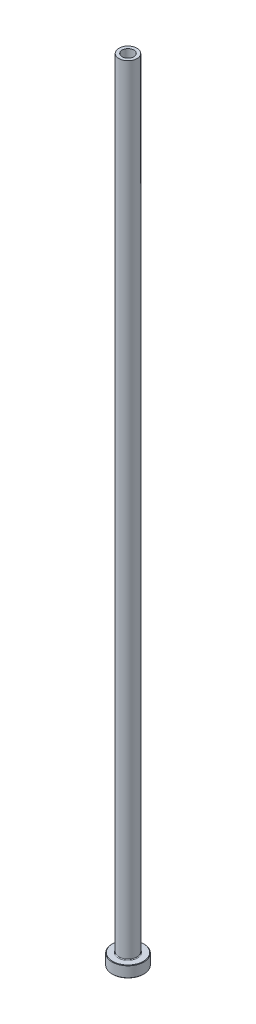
ISO-10303-21;
HEADER;
FILE_DESCRIPTION(('STEP AP214'),'2;1');
FILE_NAME('part.step','',(''),(''),'','','');
FILE_SCHEMA(('AUTOMOTIVE_DESIGN { 1 0 10303 214 1 1 1 1 }'));
ENDSEC;
DATA;
#1=APPLICATION_CONTEXT('core data for automotive mechanical design processes');
#2=APPLICATION_PROTOCOL_DEFINITION('international standard','automotive_design',2000,#1);
#3=PRODUCT_CONTEXT('',#1,'mechanical');
#4=PRODUCT('Part','Part','',(#3));
#5=PRODUCT_RELATED_PRODUCT_CATEGORY('part','',(#4));
#6=PRODUCT_DEFINITION_FORMATION('','',#4);
#7=PRODUCT_DEFINITION_CONTEXT('part definition',#1,'design');
#8=PRODUCT_DEFINITION('design','',#6,#7);
#9=PRODUCT_DEFINITION_SHAPE('','',#8);
#10=(LENGTH_UNIT() NAMED_UNIT(*) SI_UNIT(.MILLI.,.METRE.));
#11=(NAMED_UNIT(*) PLANE_ANGLE_UNIT() SI_UNIT($,.RADIAN.));
#12=(NAMED_UNIT(*) SI_UNIT($,.STERADIAN.) SOLID_ANGLE_UNIT());
#13=UNCERTAINTY_MEASURE_WITH_UNIT(LENGTH_MEASURE(1.E-05),#10,'distance_accuracy_value','');
#14=(GEOMETRIC_REPRESENTATION_CONTEXT(3) GLOBAL_UNCERTAINTY_ASSIGNED_CONTEXT((#13)) GLOBAL_UNIT_ASSIGNED_CONTEXT((#10,
#11,#12)) REPRESENTATION_CONTEXT('',''));
#15=CARTESIAN_POINT('',(0.,0.,0.));
#16=DIRECTION('',(0.,0.,1.));
#17=DIRECTION('',(1.,0.,0.));
#18=AXIS2_PLACEMENT_3D('',#15,#16,#17);
#19=CARTESIAN_POINT('',(0.,92.1876809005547,0.));
#20=DIRECTION('',(0.,1.,0.));
#21=DIRECTION('',(0.,0.,1.));
#22=AXIS2_PLACEMENT_3D('',#19,#20,#21);
#23=CYLINDRICAL_SURFACE('',#22,2.60000000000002);
#24=CARTESIAN_POINT('',(0.,350.,0.));
#25=DIRECTION('',(0.,1.,0.));
#26=DIRECTION('',(0.,0.,1.));
#27=AXIS2_PLACEMENT_3D('',#24,#25,#26);
#28=CIRCLE('',#27,2.60000000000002);
#29=CARTESIAN_POINT('',(0.,350.,2.60000000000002));
#30=VERTEX_POINT('',#29);
#31=EDGE_CURVE('E62',#30,#30,#28,.T.);
#32=ORIENTED_EDGE('',*,*,#31,.T.);
#33=EDGE_LOOP('',(#32));
#34=FACE_BOUND('',#33,.T.);
#35=CARTESIAN_POINT('',(0.,305.,0.));
#36=DIRECTION('',(0.,1.,0.));
#37=DIRECTION('',(0.,0.,1.));
#38=AXIS2_PLACEMENT_3D('',#35,#36,#37);
#39=CIRCLE('',#38,2.60000000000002);
#40=CARTESIAN_POINT('',(0.,305.,2.60000000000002));
#41=VERTEX_POINT('',#40);
#42=EDGE_CURVE('E71',#41,#41,#39,.T.);
#43=ORIENTED_EDGE('',*,*,#42,.F.);
#44=EDGE_LOOP('',(#43));
#45=FACE_BOUND('',#44,.T.);
#46=ADVANCED_FACE('F30',(#34,#45),#23,.F.);
#47=CARTESIAN_POINT('',(-2.60000000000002,350.,0.));
#48=DIRECTION('',(0.,1.,0.));
#49=DIRECTION('',(0.,0.,1.));
#50=AXIS2_PLACEMENT_3D('',#47,#48,#49);
#51=PLANE('',#50);
#52=CARTESIAN_POINT('',(0.,350.,0.));
#53=DIRECTION('',(0.,1.,0.));
#54=DIRECTION('',(0.,0.,1.));
#55=AXIS2_PLACEMENT_3D('',#52,#53,#54);
#56=CIRCLE('',#55,4.00000000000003);
#57=CARTESIAN_POINT('',(0.,350.,4.00000000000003));
#58=VERTEX_POINT('',#57);
#59=EDGE_CURVE('E65',#58,#58,#56,.T.);
#60=ORIENTED_EDGE('',*,*,#59,.T.);
#61=EDGE_LOOP('',(#60));
#62=FACE_BOUND('',#61,.T.);
#63=ORIENTED_EDGE('',*,*,#31,.F.);
#64=EDGE_LOOP('',(#63));
#65=FACE_BOUND('',#64,.T.);
#66=ADVANCED_FACE('F79',(#62,#65),#51,.T.);
#67=CARTESIAN_POINT('',(0.,92.1876809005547,0.));
#68=DIRECTION('',(0.,1.,0.));
#69=DIRECTION('',(0.,0.,1.));
#70=AXIS2_PLACEMENT_3D('',#67,#68,#69);
#71=CYLINDRICAL_SURFACE('',#70,4.00000000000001);
#72=CARTESIAN_POINT('',(0.,5.3,0.));
#73=DIRECTION('',(0.,1.,0.));
#74=DIRECTION('',(0.,0.,1.));
#75=AXIS2_PLACEMENT_3D('',#72,#73,#74);
#76=CIRCLE('',#75,4.00000000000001);
#77=CARTESIAN_POINT('',(0.,5.3,4.00000000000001));
#78=VERTEX_POINT('',#77);
#79=EDGE_CURVE('E59',#78,#78,#76,.T.);
#80=ORIENTED_EDGE('',*,*,#79,.T.);
#81=EDGE_LOOP('',(#80));
#82=FACE_BOUND('',#81,.T.);
#83=ORIENTED_EDGE('',*,*,#59,.F.);
#84=EDGE_LOOP('',(#83));
#85=FACE_BOUND('',#84,.T.);
#86=ADVANCED_FACE('F85',(#82,#85),#71,.T.);
#87=CARTESIAN_POINT('',(-3.99999999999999,5.,0.));
#88=DIRECTION('',(0.,1.,0.));
#89=DIRECTION('',(0.,0.,1.));
#90=AXIS2_PLACEMENT_3D('',#87,#88,#89);
#91=PLANE('',#90);
#92=CARTESIAN_POINT('',(0.,5.,0.));
#93=DIRECTION('',(0.,1.,0.));
#94=DIRECTION('',(0.,0.,1.));
#95=AXIS2_PLACEMENT_3D('',#92,#93,#94);
#96=CIRCLE('',#95,6.79999999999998);
#97=CARTESIAN_POINT('',(0.,5.,6.79999999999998));
#98=VERTEX_POINT('',#97);
#99=EDGE_CURVE('E53',#98,#98,#96,.T.);
#100=ORIENTED_EDGE('',*,*,#99,.T.);
#101=EDGE_LOOP('',(#100));
#102=FACE_BOUND('',#101,.T.);
#103=CARTESIAN_POINT('',(0.,5.,0.));
#104=DIRECTION('',(0.,1.,0.));
#105=DIRECTION('',(0.,0.,1.));
#106=AXIS2_PLACEMENT_3D('',#103,#104,#105);
#107=CIRCLE('',#106,4.30000000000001);
#108=CARTESIAN_POINT('',(0.,5.,4.30000000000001));
#109=VERTEX_POINT('',#108);
#110=EDGE_CURVE('E56',#109,#109,#107,.F.);
#111=ORIENTED_EDGE('',*,*,#110,.T.);
#112=EDGE_LOOP('',(#111));
#113=FACE_BOUND('',#112,.T.);
#114=ADVANCED_FACE('F111',(#102,#113),#91,.T.);
#115=CARTESIAN_POINT('',(0.,92.1876809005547,0.));
#116=DIRECTION('',(0.,1.,0.));
#117=DIRECTION('',(0.,0.,1.));
#118=AXIS2_PLACEMENT_3D('',#115,#116,#117);
#119=CYLINDRICAL_SURFACE('',#118,6.99999999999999);
#120=CARTESIAN_POINT('',(0.,4.8,0.));
#121=DIRECTION('',(0.,1.,0.));
#122=DIRECTION('',(0.,0.,1.));
#123=AXIS2_PLACEMENT_3D('',#120,#121,#122);
#124=CIRCLE('',#123,6.99999999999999);
#125=CARTESIAN_POINT('',(0.,4.8,6.99999999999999));
#126=VERTEX_POINT('',#125);
#127=EDGE_CURVE('E45',#126,#126,#124,.F.);
#128=ORIENTED_EDGE('',*,*,#127,.T.);
#129=EDGE_LOOP('',(#128));
#130=FACE_BOUND('',#129,.T.);
#131=CARTESIAN_POINT('',(0.,0.199999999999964,0.));
#132=DIRECTION('',(0.,-1.,0.));
#133=DIRECTION('',(0.,0.,-1.));
#134=AXIS2_PLACEMENT_3D('',#131,#132,#133);
#135=CIRCLE('',#134,6.99999999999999);
#136=CARTESIAN_POINT('',(0.,0.199999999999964,-6.99999999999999));
#137=VERTEX_POINT('',#136);
#138=EDGE_CURVE('E50',#137,#137,#135,.F.);
#139=ORIENTED_EDGE('',*,*,#138,.T.);
#140=EDGE_LOOP('',(#139));
#141=FACE_BOUND('',#140,.T.);
#142=ADVANCED_FACE('F108',(#130,#141),#119,.T.);
#143=CARTESIAN_POINT('',(-6.99999999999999,0.,0.));
#144=DIRECTION('',(0.,-1.,0.));
#145=DIRECTION('',(0.,0.,-1.));
#146=AXIS2_PLACEMENT_3D('',#143,#144,#145);
#147=PLANE('',#146);
#148=CARTESIAN_POINT('',(0.,0.,0.));
#149=DIRECTION('',(0.,-1.,0.));
#150=DIRECTION('',(0.,0.,-1.));
#151=AXIS2_PLACEMENT_3D('',#148,#149,#150);
#152=CIRCLE('',#151,3.35000000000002);
#153=CARTESIAN_POINT('',(0.,0.,-3.35000000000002));
#154=VERTEX_POINT('',#153);
#155=EDGE_CURVE('E37',#154,#154,#152,.F.);
#156=ORIENTED_EDGE('',*,*,#155,.T.);
#157=EDGE_LOOP('',(#156));
#158=FACE_BOUND('',#157,.T.);
#159=CARTESIAN_POINT('',(0.,0.,0.));
#160=DIRECTION('',(0.,-1.,0.));
#161=DIRECTION('',(0.,0.,-1.));
#162=AXIS2_PLACEMENT_3D('',#159,#160,#161);
#163=CIRCLE('',#162,6.80000000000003);
#164=CARTESIAN_POINT('',(0.,0.,-6.80000000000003));
#165=VERTEX_POINT('',#164);
#166=EDGE_CURVE('E41',#165,#165,#163,.T.);
#167=ORIENTED_EDGE('',*,*,#166,.T.);
#168=EDGE_LOOP('',(#167));
#169=FACE_BOUND('',#168,.T.);
#170=ADVANCED_FACE('F110',(#158,#169),#147,.T.);
#171=CARTESIAN_POINT('',(0.,92.1876809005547,0.));
#172=DIRECTION('',(0.,1.,0.));
#173=DIRECTION('',(0.,0.,1.));
#174=AXIS2_PLACEMENT_3D('',#171,#172,#173);
#175=CYLINDRICAL_SURFACE('',#174,2.85000000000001);
#176=CARTESIAN_POINT('',(0.,0.5,0.));
#177=DIRECTION('',(0.,-1.,0.));
#178=DIRECTION('',(0.,0.,-1.));
#179=AXIS2_PLACEMENT_3D('',#176,#177,#178);
#180=CIRCLE('',#179,2.85000000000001);
#181=CARTESIAN_POINT('',(0.,0.5,-2.85000000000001));
#182=VERTEX_POINT('',#181);
#183=EDGE_CURVE('E10',#182,#182,#180,.T.);
#184=ORIENTED_EDGE('',*,*,#183,.T.);
#185=EDGE_LOOP('',(#184));
#186=FACE_BOUND('',#185,.T.);
#187=CARTESIAN_POINT('',(0.,293.,0.));
#188=DIRECTION('',(0.,1.,0.));
#189=DIRECTION('',(0.,0.,1.));
#190=AXIS2_PLACEMENT_3D('',#187,#188,#189);
#191=CIRCLE('',#190,2.85000000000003);
#192=CARTESIAN_POINT('',(0.,293.,2.85000000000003));
#193=VERTEX_POINT('',#192);
#194=EDGE_CURVE('E68',#193,#193,#191,.T.);
#195=ORIENTED_EDGE('',*,*,#194,.T.);
#196=EDGE_LOOP('',(#195));
#197=FACE_BOUND('',#196,.T.);
#198=ADVANCED_FACE('F118',(#186,#197),#175,.F.);
#199=CARTESIAN_POINT('',(0.,293.,0.));
#200=DIRECTION('',(0.,-1.,0.));
#201=DIRECTION('',(0.,0.,-1.));
#202=AXIS2_PLACEMENT_3D('',#199,#200,#201);
#203=CONICAL_SURFACE('',#202,2.85000000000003,0.0208303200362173);
#204=ORIENTED_EDGE('',*,*,#42,.T.);
#205=EDGE_LOOP('',(#204));
#206=FACE_BOUND('',#205,.T.);
#207=ORIENTED_EDGE('',*,*,#194,.F.);
#208=EDGE_LOOP('',(#207));
#209=FACE_BOUND('',#208,.T.);
#210=ADVANCED_FACE('F75',(#206,#209),#203,.F.);
#211=CARTESIAN_POINT('',(0.,5.3,0.));
#212=DIRECTION('',(0.,1.,0.));
#213=DIRECTION('',(0.,0.,1.));
#214=AXIS2_PLACEMENT_3D('',#211,#212,#213);
#215=TOROIDAL_SURFACE('',#214,4.30000000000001,0.3);
#216=ORIENTED_EDGE('',*,*,#110,.F.);
#217=EDGE_LOOP('',(#216));
#218=FACE_BOUND('',#217,.T.);
#219=ORIENTED_EDGE('',*,*,#79,.F.);
#220=EDGE_LOOP('',(#219));
#221=FACE_BOUND('',#220,.T.);
#222=ADVANCED_FACE('F90',(#218,#221),#215,.F.);
#223=CARTESIAN_POINT('',(0.,5.,0.));
#224=DIRECTION('',(0.,-1.,0.));
#225=DIRECTION('',(0.,0.,-1.));
#226=AXIS2_PLACEMENT_3D('',#223,#224,#225);
#227=CONICAL_SURFACE('',#226,6.79999999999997,0.785398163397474);
#228=ORIENTED_EDGE('',*,*,#127,.F.);
#229=EDGE_LOOP('',(#228));
#230=FACE_BOUND('',#229,.T.);
#231=ORIENTED_EDGE('',*,*,#99,.F.);
#232=EDGE_LOOP('',(#231));
#233=FACE_BOUND('',#232,.T.);
#234=ADVANCED_FACE('F93',(#230,#233),#227,.T.);
#235=CARTESIAN_POINT('',(0.,0.199999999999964,0.));
#236=DIRECTION('',(0.,1.,0.));
#237=DIRECTION('',(0.,0.,1.));
#238=AXIS2_PLACEMENT_3D('',#235,#236,#237);
#239=CONICAL_SURFACE('',#238,6.99999999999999,0.78539816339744);
#240=ORIENTED_EDGE('',*,*,#166,.F.);
#241=EDGE_LOOP('',(#240));
#242=FACE_BOUND('',#241,.T.);
#243=ORIENTED_EDGE('',*,*,#138,.F.);
#244=EDGE_LOOP('',(#243));
#245=FACE_BOUND('',#244,.T.);
#246=ADVANCED_FACE('F96',(#242,#245),#239,.T.);
#247=CARTESIAN_POINT('',(0.,0.,0.));
#248=DIRECTION('',(0.,-1.,0.));
#249=DIRECTION('',(0.,0.,-1.));
#250=AXIS2_PLACEMENT_3D('',#247,#248,#249);
#251=CONICAL_SURFACE('',#250,3.35000000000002,0.78539816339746);
#252=ORIENTED_EDGE('',*,*,#183,.F.);
#253=EDGE_LOOP('',(#252));
#254=FACE_BOUND('',#253,.T.);
#255=ORIENTED_EDGE('',*,*,#155,.F.);
#256=EDGE_LOOP('',(#255));
#257=FACE_BOUND('',#256,.T.);
#258=ADVANCED_FACE('F32',(#254,#257),#251,.F.);
#259=CLOSED_SHELL('',(#46,#66,#86,#114,#142,#170,#198,#210,#222,#234,#246,#258));
#260=MANIFOLD_SOLID_BREP('B2',#259);
#261=ADVANCED_BREP_SHAPE_REPRESENTATION('',(#18,#260),#14);
#262=SHAPE_DEFINITION_REPRESENTATION(#9,#261);
ENDSEC;
END-ISO-10303-21;
